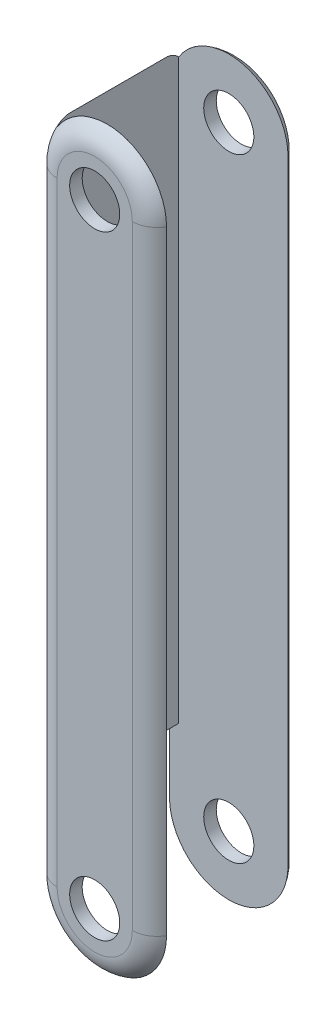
ISO-10303-21;
HEADER;
FILE_DESCRIPTION(('STEP AP214'),'2;1');
FILE_NAME('part.step','',(''),(''),'','','');
FILE_SCHEMA(('AUTOMOTIVE_DESIGN { 1 0 10303 214 1 1 1 1 }'));
ENDSEC;
DATA;
#1=APPLICATION_CONTEXT('core data for automotive mechanical design processes');
#2=APPLICATION_PROTOCOL_DEFINITION('international standard','automotive_design',2000,#1);
#3=PRODUCT_CONTEXT('',#1,'mechanical');
#4=PRODUCT('Part','Part','',(#3));
#5=PRODUCT_RELATED_PRODUCT_CATEGORY('part','',(#4));
#6=PRODUCT_DEFINITION_FORMATION('','',#4);
#7=PRODUCT_DEFINITION_CONTEXT('part definition',#1,'design');
#8=PRODUCT_DEFINITION('design','',#6,#7);
#9=PRODUCT_DEFINITION_SHAPE('','',#8);
#10=(LENGTH_UNIT() NAMED_UNIT(*) SI_UNIT(.MILLI.,.METRE.));
#11=(NAMED_UNIT(*) PLANE_ANGLE_UNIT() SI_UNIT($,.RADIAN.));
#12=(NAMED_UNIT(*) SI_UNIT($,.STERADIAN.) SOLID_ANGLE_UNIT());
#13=UNCERTAINTY_MEASURE_WITH_UNIT(LENGTH_MEASURE(1.E-05),#10,'distance_accuracy_value','');
#14=(GEOMETRIC_REPRESENTATION_CONTEXT(3) GLOBAL_UNCERTAINTY_ASSIGNED_CONTEXT((#13)) GLOBAL_UNIT_ASSIGNED_CONTEXT((#10,
#11,#12)) REPRESENTATION_CONTEXT('',''));
#15=CARTESIAN_POINT('',(0.,0.,0.));
#16=DIRECTION('',(0.,0.,1.));
#17=DIRECTION('',(1.,0.,0.));
#18=AXIS2_PLACEMENT_3D('',#15,#16,#17);
#19=CARTESIAN_POINT('',(5.,49.,11.7));
#20=DIRECTION('',(0.,0.,-1.));
#21=DIRECTION('',(-1.,0.,0.));
#22=AXIS2_PLACEMENT_3D('',#19,#20,#21);
#23=CYLINDRICAL_SURFACE('',#22,5.);
#24=CARTESIAN_POINT('',(5.,49.,9.7));
#25=DIRECTION('',(0.,0.,1.));
#26=DIRECTION('',(1.,0.,0.));
#27=AXIS2_PLACEMENT_3D('',#24,#25,#26);
#28=CIRCLE('',#27,5.);
#29=CARTESIAN_POINT('',(0.,49.,9.7));
#30=VERTEX_POINT('',#29);
#31=CARTESIAN_POINT('',(1.,52.,9.7));
#32=VERTEX_POINT('',#31);
#33=EDGE_CURVE('E260',#30,#32,#28,.F.);
#34=ORIENTED_EDGE('',*,*,#33,.T.);
#35=DIRECTION('',(0.,0.,-1.));
#36=VECTOR('',#35,1.);
#37=CARTESIAN_POINT('',(1.,52.,11.7));
#38=LINE('',#37,#36);
#39=CARTESIAN_POINT('',(1.,52.,2.));
#40=VERTEX_POINT('',#39);
#41=EDGE_CURVE('E170',#32,#40,#38,.T.);
#42=ORIENTED_EDGE('',*,*,#41,.T.);
#43=CARTESIAN_POINT('',(5.,49.,2.));
#44=DIRECTION('',(0.,0.,1.));
#45=DIRECTION('',(1.,0.,0.));
#46=AXIS2_PLACEMENT_3D('',#43,#44,#45);
#47=CIRCLE('',#46,5.);
#48=CARTESIAN_POINT('',(0.,49.,2.));
#49=VERTEX_POINT('',#48);
#50=EDGE_CURVE('E61',#40,#49,#47,.T.);
#51=ORIENTED_EDGE('',*,*,#50,.T.);
#52=DIRECTION('',(0.,0.,-1.));
#53=VECTOR('',#52,1.);
#54=CARTESIAN_POINT('',(0.,49.,11.7));
#55=LINE('',#54,#53);
#56=EDGE_CURVE('E252',#30,#49,#55,.T.);
#57=ORIENTED_EDGE('',*,*,#56,.F.);
#58=EDGE_LOOP('',(#34,#42,#51,#57));
#59=FACE_BOUND('',#58,.T.);
#60=ADVANCED_FACE('F35',(#59),#23,.T.);
#61=CARTESIAN_POINT('',(0.,49.,11.7));
#62=DIRECTION('',(1.,0.,0.));
#63=DIRECTION('',(0.,0.,-1.));
#64=AXIS2_PLACEMENT_3D('',#61,#62,#63);
#65=PLANE('',#64);
#66=DIRECTION('',(0.,-1.,0.));
#67=VECTOR('',#66,1.);
#68=CARTESIAN_POINT('',(0.,49.,2.));
#69=LINE('',#68,#67);
#70=CARTESIAN_POINT('',(0.,5.45907280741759,2.));
#71=VERTEX_POINT('',#70);
#72=EDGE_CURVE('E267',#49,#71,#69,.T.);
#73=ORIENTED_EDGE('',*,*,#72,.T.);
#74=DIRECTION('',(0.,0.,-1.));
#75=VECTOR('',#74,1.);
#76=CARTESIAN_POINT('',(0.,5.45907280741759,10.7));
#77=LINE('',#76,#75);
#78=CARTESIAN_POINT('',(0.,5.45907280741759,9.7));
#79=VERTEX_POINT('',#78);
#80=EDGE_CURVE('E149',#79,#71,#77,.T.);
#81=ORIENTED_EDGE('',*,*,#80,.F.);
#82=DIRECTION('',(0.,-1.,0.));
#83=VECTOR('',#82,1.);
#84=CARTESIAN_POINT('',(0.,49.,9.7));
#85=LINE('',#84,#83);
#86=EDGE_CURVE('E154',#79,#30,#85,.F.);
#87=ORIENTED_EDGE('',*,*,#86,.T.);
#88=ORIENTED_EDGE('',*,*,#56,.T.);
#89=EDGE_LOOP('',(#73,#81,#87,#88));
#90=FACE_BOUND('',#89,.T.);
#91=ADVANCED_FACE('F214',(#90),#65,.F.);
#92=CARTESIAN_POINT('',(5.,49.,11.7));
#93=DIRECTION('',(0.,0.,1.));
#94=DIRECTION('',(1.,0.,0.));
#95=AXIS2_PLACEMENT_3D('',#92,#93,#94);
#96=PLANE('',#95);
#97=CARTESIAN_POINT('',(5.,49.,11.7));
#98=DIRECTION('',(0.,0.,-1.));
#99=DIRECTION('',(-1.,0.,0.));
#100=AXIS2_PLACEMENT_3D('',#97,#98,#99);
#101=CIRCLE('',#100,2.);
#102=CARTESIAN_POINT('',(3.,49.,11.7));
#103=VERTEX_POINT('',#102);
#104=EDGE_CURVE('E379',#103,#103,#101,.T.);
#105=ORIENTED_EDGE('',*,*,#104,.T.);
#106=EDGE_LOOP('',(#105));
#107=FACE_BOUND('',#106,.T.);
#108=CARTESIAN_POINT('',(5.,0.,11.7));
#109=DIRECTION('',(0.,0.,-1.));
#110=DIRECTION('',(-1.,0.,0.));
#111=AXIS2_PLACEMENT_3D('',#108,#109,#110);
#112=CIRCLE('',#111,2.);
#113=CARTESIAN_POINT('',(3.,0.,11.7));
#114=VERTEX_POINT('',#113);
#115=EDGE_CURVE('E287',#114,#114,#112,.T.);
#116=ORIENTED_EDGE('',*,*,#115,.T.);
#117=EDGE_LOOP('',(#116));
#118=FACE_BOUND('',#117,.T.);
#119=DIRECTION('',(0.,-1.,0.));
#120=VECTOR('',#119,1.);
#121=CARTESIAN_POINT('',(2.,0.,11.7));
#122=LINE('',#121,#120);
#123=CARTESIAN_POINT('',(2.,49.,11.7));
#124=VERTEX_POINT('',#123);
#125=CARTESIAN_POINT('',(2.,0.,11.7));
#126=VERTEX_POINT('',#125);
#127=EDGE_CURVE('E323',#124,#126,#122,.T.);
#128=ORIENTED_EDGE('',*,*,#127,.T.);
#129=CARTESIAN_POINT('',(5.,0.,11.7));
#130=DIRECTION('',(0.,0.,1.));
#131=DIRECTION('',(1.,0.,0.));
#132=AXIS2_PLACEMENT_3D('',#129,#130,#131);
#133=CIRCLE('',#132,3.);
#134=CARTESIAN_POINT('',(8.,0.,11.7));
#135=VERTEX_POINT('',#134);
#136=EDGE_CURVE('E327',#126,#135,#133,.T.);
#137=ORIENTED_EDGE('',*,*,#136,.T.);
#138=DIRECTION('',(0.,1.,0.));
#139=VECTOR('',#138,1.);
#140=CARTESIAN_POINT('',(8.,49.,11.7));
#141=LINE('',#140,#139);
#142=CARTESIAN_POINT('',(8.,49.,11.7));
#143=VERTEX_POINT('',#142);
#144=EDGE_CURVE('E325',#135,#143,#141,.T.);
#145=ORIENTED_EDGE('',*,*,#144,.T.);
#146=CARTESIAN_POINT('',(5.,49.,11.7));
#147=DIRECTION('',(0.,0.,1.));
#148=DIRECTION('',(1.,0.,0.));
#149=AXIS2_PLACEMENT_3D('',#146,#147,#148);
#150=CIRCLE('',#149,3.);
#151=EDGE_CURVE('E248',#143,#124,#150,.T.);
#152=ORIENTED_EDGE('',*,*,#151,.T.);
#153=EDGE_LOOP('',(#128,#137,#145,#152));
#154=FACE_BOUND('',#153,.T.);
#155=ADVANCED_FACE('F219',(#107,#118,#154),#96,.T.);
#156=CARTESIAN_POINT('',(5.,49.,0.));
#157=DIRECTION('',(0.,0.,1.));
#158=DIRECTION('',(1.,0.,0.));
#159=AXIS2_PLACEMENT_3D('',#156,#157,#158);
#160=PLANE('',#159);
#161=CARTESIAN_POINT('',(5.,49.,0.));
#162=DIRECTION('',(0.,0.,-1.));
#163=DIRECTION('',(-1.,0.,0.));
#164=AXIS2_PLACEMENT_3D('',#161,#162,#163);
#165=CIRCLE('',#164,2.);
#166=CARTESIAN_POINT('',(3.,49.,0.));
#167=VERTEX_POINT('',#166);
#168=EDGE_CURVE('E377',#167,#167,#165,.T.);
#169=ORIENTED_EDGE('',*,*,#168,.F.);
#170=EDGE_LOOP('',(#169));
#171=FACE_BOUND('',#170,.T.);
#172=CARTESIAN_POINT('',(5.,0.,0.));
#173=DIRECTION('',(0.,0.,-1.));
#174=DIRECTION('',(-1.,0.,0.));
#175=AXIS2_PLACEMENT_3D('',#172,#173,#174);
#176=CIRCLE('',#175,2.);
#177=CARTESIAN_POINT('',(3.,0.,0.));
#178=VERTEX_POINT('',#177);
#179=EDGE_CURVE('E293',#178,#178,#176,.T.);
#180=ORIENTED_EDGE('',*,*,#179,.F.);
#181=EDGE_LOOP('',(#180));
#182=FACE_BOUND('',#181,.T.);
#183=DIRECTION('',(0.,1.,0.));
#184=VECTOR('',#183,1.);
#185=CARTESIAN_POINT('',(8.,49.,0.));
#186=LINE('',#185,#184);
#187=CARTESIAN_POINT('',(8.,49.,0.));
#188=VERTEX_POINT('',#187);
#189=CARTESIAN_POINT('',(8.,0.,0.));
#190=VERTEX_POINT('',#189);
#191=EDGE_CURVE('E262',#188,#190,#186,.F.);
#192=ORIENTED_EDGE('',*,*,#191,.T.);
#193=CARTESIAN_POINT('',(5.,0.,0.));
#194=DIRECTION('',(0.,0.,1.));
#195=DIRECTION('',(1.,0.,0.));
#196=AXIS2_PLACEMENT_3D('',#193,#194,#195);
#197=CIRCLE('',#196,3.);
#198=CARTESIAN_POINT('',(2.,0.,0.));
#199=VERTEX_POINT('',#198);
#200=EDGE_CURVE('E264',#190,#199,#197,.F.);
#201=ORIENTED_EDGE('',*,*,#200,.T.);
#202=DIRECTION('',(0.,-1.,0.));
#203=VECTOR('',#202,1.);
#204=CARTESIAN_POINT('',(2.,49.,0.));
#205=LINE('',#204,#203);
#206=CARTESIAN_POINT('',(2.,49.,0.));
#207=VERTEX_POINT('',#206);
#208=EDGE_CURVE('E259',#199,#207,#205,.F.);
#209=ORIENTED_EDGE('',*,*,#208,.T.);
#210=CARTESIAN_POINT('',(5.,49.,0.));
#211=DIRECTION('',(0.,0.,1.));
#212=DIRECTION('',(1.,0.,0.));
#213=AXIS2_PLACEMENT_3D('',#210,#211,#212);
#214=CIRCLE('',#213,3.);
#215=EDGE_CURVE('E257',#207,#188,#214,.F.);
#216=ORIENTED_EDGE('',*,*,#215,.T.);
#217=EDGE_LOOP('',(#192,#201,#209,#216));
#218=FACE_BOUND('',#217,.T.);
#219=ADVANCED_FACE('F193',(#171,#182,#218),#160,.F.);
#220=CARTESIAN_POINT('',(5.,49.,9.7));
#221=DIRECTION('',(0.,0.,1.));
#222=DIRECTION('',(1.,0.,0.));
#223=AXIS2_PLACEMENT_3D('',#220,#221,#222);
#224=TOROIDAL_SURFACE('',#223,3.,2.);
#225=CARTESIAN_POINT('',(5.,49.,10.7));
#226=DIRECTION('',(0.,0.,1.));
#227=DIRECTION('',(0.,-1.,0.));
#228=AXIS2_PLACEMENT_3D('',#225,#226,#227);
#229=CIRCLE('',#228,4.73205080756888);
#230=CARTESIAN_POINT('',(1.,51.5283007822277,10.7));
#231=VERTEX_POINT('',#230);
#232=CARTESIAN_POINT('',(9.73205080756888,49.,10.7));
#233=VERTEX_POINT('',#232);
#234=EDGE_CURVE('E241',#231,#233,#229,.F.);
#235=ORIENTED_EDGE('',*,*,#234,.F.);
#236=CARTESIAN_POINT('',(1.,51.8049990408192,10.3670267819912));
#237=CARTESIAN_POINT('',(1.,51.7494559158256,10.4571497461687));
#238=CARTESIAN_POINT('',(1.,51.6838486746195,10.5411533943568));
#239=CARTESIAN_POINT('',(1.,51.5380351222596,10.6954518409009));
#240=CARTESIAN_POINT('',(1.,51.4577741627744,10.7656932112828));
#241=CARTESIAN_POINT('',(1.,51.262254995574,10.9114934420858));
#242=CARTESIAN_POINT('',(1.,51.1436542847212,10.9825170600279));
#243=CARTESIAN_POINT('',(1.,50.8970590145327,11.1050984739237));
#244=CARTESIAN_POINT('',(1.,50.7690564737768,11.1566394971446));
#245=CARTESIAN_POINT('',(1.,50.5228979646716,11.238888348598));
#246=CARTESIAN_POINT('',(1.,50.4052940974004,11.2713065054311));
#247=CARTESIAN_POINT('',(1.,50.1676975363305,11.3259995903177));
#248=CARTESIAN_POINT('',(1.,50.0477027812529,11.3482653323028));
#249=CARTESIAN_POINT('',(1.,49.8059350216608,11.3844989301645));
#250=CARTESIAN_POINT('',(1.,49.684156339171,11.3984276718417));
#251=CARTESIAN_POINT('',(1.,49.44005116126,11.4190868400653));
#252=CARTESIAN_POINT('',(1.,49.3177248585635,11.425819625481));
#253=CARTESIAN_POINT('',(1.,49.0561752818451,11.4332359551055));
#254=CARTESIAN_POINT('',(1.,48.916925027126,11.4329682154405));
#255=CARTESIAN_POINT('',(1.,48.63861658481,11.4239813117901));
#256=CARTESIAN_POINT('',(1.,48.4995585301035,11.4152578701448));
#257=CARTESIAN_POINT('',(1.,48.2230908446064,11.388327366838));
#258=CARTESIAN_POINT('',(1.,48.0856763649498,11.3701719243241));
#259=CARTESIAN_POINT('',(1.,47.8129316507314,11.322365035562));
#260=CARTESIAN_POINT('',(1.,47.6775991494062,11.292727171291));
#261=CARTESIAN_POINT('',(1.,47.4368360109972,11.2262150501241));
#262=CARTESIAN_POINT('',(1.,47.3307168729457,11.1918758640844));
#263=CARTESIAN_POINT('',(1.,47.1225973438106,11.1119698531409));
#264=CARTESIAN_POINT('',(1.,47.020600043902,11.0663947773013));
#265=CARTESIAN_POINT('',(1.,46.8224631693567,10.9616206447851));
#266=CARTESIAN_POINT('',(1.,46.7263889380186,10.9022954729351));
#267=CARTESIAN_POINT('',(1.,46.5452630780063,10.7686213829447));
#268=CARTESIAN_POINT('',(1.,46.4601898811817,10.6943026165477));
#269=CARTESIAN_POINT('',(1.,46.3289326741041,10.5541171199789));
#270=CARTESIAN_POINT('',(1.,46.2786425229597,10.492105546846));
#271=CARTESIAN_POINT('',(1.,46.1886400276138,10.360766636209));
#272=CARTESIAN_POINT('',(1.,46.148922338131,10.2914430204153));
#273=CARTESIAN_POINT('',(1.,46.0821739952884,10.1461751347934));
#274=CARTESIAN_POINT('',(1.,46.0552484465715,10.070181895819));
#275=CARTESIAN_POINT('',(1.,46.0166099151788,9.91441021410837));
#276=CARTESIAN_POINT('',(1.,46.0048856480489,9.83463462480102));
#277=CARTESIAN_POINT('',(1.,45.9980366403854,9.68416995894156));
#278=CARTESIAN_POINT('',(1.,46.001060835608,9.61356002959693));
#279=CARTESIAN_POINT('',(1.,46.0193349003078,9.47396038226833));
#280=CARTESIAN_POINT('',(1.,46.0345827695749,9.40497040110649));
#281=CARTESIAN_POINT('',(1.,46.0757165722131,9.27254940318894));
#282=CARTESIAN_POINT('',(1.,46.101270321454,9.20901379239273));
#283=CARTESIAN_POINT('',(1.,46.1616385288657,9.08653782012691));
#284=CARTESIAN_POINT('',(1.,46.1964564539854,9.02759918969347));
#285=CARTESIAN_POINT('',(1.,46.288344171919,8.89406099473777));
#286=CARTESIAN_POINT('',(1.,46.3488677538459,8.82183493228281));
#287=CARTESIAN_POINT('',(1.,46.4808336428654,8.68818613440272));
#288=CARTESIAN_POINT('',(1.,46.5522960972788,8.62678379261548));
#289=CARTESIAN_POINT('',(1.,46.7361735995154,8.48969787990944));
#290=CARTESIAN_POINT('',(1.,46.8527590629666,8.41964267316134));
#291=CARTESIAN_POINT('',(1.,47.0952161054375,8.29838023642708));
#292=CARTESIAN_POINT('',(1.,47.2211039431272,8.24720699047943));
#293=CARTESIAN_POINT('',(1.,47.4640616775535,8.16501814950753));
#294=CARTESIAN_POINT('',(1.,47.5806137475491,8.13242151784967));
#295=CARTESIAN_POINT('',(1.,47.816127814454,8.07729729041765));
#296=CARTESIAN_POINT('',(1.,47.9350919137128,8.05477891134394));
#297=CARTESIAN_POINT('',(1.,48.1747797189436,8.01798954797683));
#298=CARTESIAN_POINT('',(1.,48.2955088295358,8.0037548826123));
#299=CARTESIAN_POINT('',(1.,48.5375349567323,7.98242360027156));
#300=CARTESIAN_POINT('',(1.,48.658831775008,7.97532465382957));
#301=CARTESIAN_POINT('',(1.,48.9180728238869,7.96704252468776));
#302=CARTESIAN_POINT('',(1.,49.0560467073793,7.9667907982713));
#303=CARTESIAN_POINT('',(1.,49.3318361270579,7.97455043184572));
#304=CARTESIAN_POINT('',(1.,49.4696515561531,7.98256573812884));
#305=CARTESIAN_POINT('',(1.,49.7437572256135,8.00779632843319));
#306=CARTESIAN_POINT('',(1.,49.8800516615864,8.02496434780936));
#307=CARTESIAN_POINT('',(1.,50.150714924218,8.0703853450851));
#308=CARTESIAN_POINT('',(1.,50.2850856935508,8.09862618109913));
#309=CARTESIAN_POINT('',(1.,50.5267941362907,8.1627535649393));
#310=CARTESIAN_POINT('',(1.,50.6347134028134,8.19640760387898));
#311=CARTESIAN_POINT('',(1.,50.8465401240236,8.27504247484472));
#312=CARTESIAN_POINT('',(1.,50.9504445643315,8.32003163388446));
#313=CARTESIAN_POINT('',(1.,51.1525266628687,8.42381451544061));
#314=CARTESIAN_POINT('',(1.,51.2506396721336,8.48273677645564));
#315=CARTESIAN_POINT('',(1.,51.4359102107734,8.61591229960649));
#316=CARTESIAN_POINT('',(1.,51.5230896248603,8.69013412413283));
#317=CARTESIAN_POINT('',(1.,51.6575315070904,8.83014508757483));
#318=CARTESIAN_POINT('',(1.,51.7089672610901,8.89191570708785));
#319=CARTESIAN_POINT('',(1.,51.8013192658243,9.0229428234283));
#320=CARTESIAN_POINT('',(1.,51.8422406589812,9.09219563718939));
#321=CARTESIAN_POINT('',(1.,51.9114113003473,9.23755450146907));
#322=CARTESIAN_POINT('',(1.,51.939552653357,9.31371261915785));
#323=CARTESIAN_POINT('',(1.,51.9805177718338,9.4700582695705));
#324=CARTESIAN_POINT('',(1.,51.9933530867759,9.55024271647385));
#325=CARTESIAN_POINT('',(1.,52.0020832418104,9.70146500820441));
#326=CARTESIAN_POINT('',(1.,51.9998892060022,9.77239794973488));
#327=CARTESIAN_POINT('',(1.,51.9831332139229,9.91275980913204));
#328=CARTESIAN_POINT('',(1.,51.9685764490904,9.9821893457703));
#329=CARTESIAN_POINT('',(1.,51.9316234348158,10.1056150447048));
#330=CARTESIAN_POINT('',(1.,51.9110619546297,10.1601739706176));
#331=CARTESIAN_POINT('',(1.,51.8630129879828,10.266113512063));
#332=CARTESIAN_POINT('',(1.,51.8355260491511,10.3174943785));
#333=CARTESIAN_POINT('',(1.,51.8049990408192,10.3670267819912));
#334=B_SPLINE_CURVE_WITH_KNOTS('',3,(#236,#237,#238,#239,#240,#241,#242,#243,#244,#245,#246,
#247,#248,#249,#250,#251,#252,#253,#254,#255,#256,#257,#258,#259,#260,#261,#262,#263,#264,#265,
#266,#267,#268,#269,#270,#271,#272,#273,#274,#275,#276,#277,#278,#279,#280,#281,#282,#283,#284,
#285,#286,#287,#288,#289,#290,#291,#292,#293,#294,#295,#296,#297,#298,#299,#300,#301,#302,#303,
#304,#305,#306,#307,#308,#309,#310,#311,#312,#313,#314,#315,#316,#317,#318,#319,#320,#321,#322,
#323,#324,#325,#326,#327,#328,#329,#330,#331,#332,#333),.UNSPECIFIED.,.T.,.F.,(4,2,2,2,2,2,2,2,
2,2,2,2,2,2,2,2,2,2,2,2,2,2,2,2,2,2,2,2,2,2,2,2,2,2,2,2,2,2,2,2,2,2,2,2,2,2,2,2,4),(0.,
0.317285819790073,0.635780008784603,1.04815189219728,1.46087798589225,1.82631752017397,
2.1920870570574,2.55955946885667,2.92691138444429,3.34441221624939,3.76212436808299,
4.17757419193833,4.59253409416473,4.92664318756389,5.26099836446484,5.59855089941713,
5.93543127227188,6.17407342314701,6.41259468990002,6.65304321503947,6.89331314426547,
7.10426269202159,7.31517772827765,7.51977774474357,7.72445443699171,8.00558356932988,
8.2872368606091,8.69299180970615,9.09947352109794,9.46201522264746,9.82488779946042,
10.1893395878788,10.5536723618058,10.9673504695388,11.381226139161,11.7929849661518,
12.2042935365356,12.5429296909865,12.8818153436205,13.2239585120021,13.5654055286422,
13.8056729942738,14.0458227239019,14.287963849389,14.529922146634,14.7417392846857,
14.9534675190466,15.1278644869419,15.3022476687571),.UNSPECIFIED.);
#335=EDGE_CURVE('E181',#32,#231,#334,.T.);
#336=ORIENTED_EDGE('',*,*,#335,.F.);
#337=ORIENTED_EDGE('',*,*,#33,.F.);
#338=CARTESIAN_POINT('',(2.,49.,9.7));
#339=DIRECTION('',(0.,-1.,0.));
#340=DIRECTION('',(0.,0.,-1.));
#341=AXIS2_PLACEMENT_3D('',#338,#339,#340);
#342=CIRCLE('',#341,2.);
#343=EDGE_CURVE('E249',#124,#30,#342,.T.);
#344=ORIENTED_EDGE('',*,*,#343,.F.);
#345=ORIENTED_EDGE('',*,*,#151,.F.);
#346=CARTESIAN_POINT('',(8.,49.,9.7));
#347=DIRECTION('',(0.,-1.,0.));
#348=DIRECTION('',(0.,0.,-1.));
#349=AXIS2_PLACEMENT_3D('',#346,#347,#348);
#350=CIRCLE('',#349,2.);
#351=EDGE_CURVE('E238',#233,#143,#350,.T.);
#352=ORIENTED_EDGE('',*,*,#351,.F.);
#353=EDGE_LOOP('',(#235,#336,#337,#344,#345,#352));
#354=FACE_BOUND('',#353,.T.);
#355=ADVANCED_FACE('F188',(#354),#224,.T.);
#356=CARTESIAN_POINT('',(2.,49.,9.7));
#357=DIRECTION('',(0.,1.,0.));
#358=DIRECTION('',(0.,0.,1.));
#359=AXIS2_PLACEMENT_3D('',#356,#357,#358);
#360=CYLINDRICAL_SURFACE('',#359,2.);
#361=CARTESIAN_POINT('',(2.,5.45907280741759,9.7));
#362=DIRECTION('',(0.,1.,0.));
#363=DIRECTION('',(0.,0.,1.));
#364=AXIS2_PLACEMENT_3D('',#361,#362,#363);
#365=CIRCLE('',#364,2.);
#366=CARTESIAN_POINT('',(0.267949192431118,5.45907280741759,10.7));
#367=VERTEX_POINT('',#366);
#368=EDGE_CURVE('E146',#367,#79,#365,.F.);
#369=ORIENTED_EDGE('',*,*,#368,.F.);
#370=DIRECTION('',(0.,1.,0.));
#371=VECTOR('',#370,1.);
#372=CARTESIAN_POINT('',(0.267949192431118,49.,10.7));
#373=LINE('',#372,#371);
#374=CARTESIAN_POINT('',(0.267949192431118,0.,10.7));
#375=VERTEX_POINT('',#374);
#376=EDGE_CURVE('E134',#375,#367,#373,.T.);
#377=ORIENTED_EDGE('',*,*,#376,.F.);
#378=CARTESIAN_POINT('',(2.,0.,9.7));
#379=DIRECTION('',(0.,-1.,0.));
#380=DIRECTION('',(1.,0.,0.));
#381=AXIS2_PLACEMENT_3D('',#378,#379,#380);
#382=CIRCLE('',#381,2.);
#383=EDGE_CURVE('E250',#126,#375,#382,.T.);
#384=ORIENTED_EDGE('',*,*,#383,.F.);
#385=ORIENTED_EDGE('',*,*,#127,.F.);
#386=ORIENTED_EDGE('',*,*,#343,.T.);
#387=ORIENTED_EDGE('',*,*,#86,.F.);
#388=EDGE_LOOP('',(#369,#377,#384,#385,#386,#387));
#389=FACE_BOUND('',#388,.T.);
#390=ADVANCED_FACE('F152',(#389),#360,.T.);
#391=CARTESIAN_POINT('',(8.,49.,9.7));
#392=DIRECTION('',(0.,-1.,0.));
#393=DIRECTION('',(0.,0.,-1.));
#394=AXIS2_PLACEMENT_3D('',#391,#392,#393);
#395=CYLINDRICAL_SURFACE('',#394,2.);
#396=DIRECTION('',(0.,-1.,0.));
#397=VECTOR('',#396,1.);
#398=CARTESIAN_POINT('',(9.73205080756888,49.,10.7));
#399=LINE('',#398,#397);
#400=CARTESIAN_POINT('',(9.73205080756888,0.,10.7));
#401=VERTEX_POINT('',#400);
#402=EDGE_CURVE('E235',#233,#401,#399,.T.);
#403=ORIENTED_EDGE('',*,*,#402,.F.);
#404=ORIENTED_EDGE('',*,*,#351,.T.);
#405=ORIENTED_EDGE('',*,*,#144,.F.);
#406=CARTESIAN_POINT('',(8.,0.,9.7));
#407=DIRECTION('',(0.,-1.,0.));
#408=DIRECTION('',(0.,0.,-1.));
#409=AXIS2_PLACEMENT_3D('',#406,#407,#408);
#410=CIRCLE('',#409,2.);
#411=EDGE_CURVE('E240',#401,#135,#410,.T.);
#412=ORIENTED_EDGE('',*,*,#411,.F.);
#413=EDGE_LOOP('',(#403,#404,#405,#412));
#414=FACE_BOUND('',#413,.T.);
#415=ADVANCED_FACE('F226',(#414),#395,.T.);
#416=CARTESIAN_POINT('',(5.,0.,9.7));
#417=DIRECTION('',(0.,0.,1.));
#418=DIRECTION('',(1.,0.,0.));
#419=AXIS2_PLACEMENT_3D('',#416,#417,#418);
#420=TOROIDAL_SURFACE('',#419,3.,2.);
#421=ORIENTED_EDGE('',*,*,#383,.T.);
#422=CARTESIAN_POINT('',(5.,0.,10.7));
#423=DIRECTION('',(0.,0.,1.));
#424=DIRECTION('',(0.,-1.,0.));
#425=AXIS2_PLACEMENT_3D('',#422,#423,#424);
#426=CIRCLE('',#425,4.73205080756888);
#427=EDGE_CURVE('E45',#401,#375,#426,.F.);
#428=ORIENTED_EDGE('',*,*,#427,.F.);
#429=ORIENTED_EDGE('',*,*,#411,.T.);
#430=ORIENTED_EDGE('',*,*,#136,.F.);
#431=EDGE_LOOP('',(#421,#428,#429,#430));
#432=FACE_BOUND('',#431,.T.);
#433=ADVANCED_FACE('F210',(#432),#420,.T.);
#434=CARTESIAN_POINT('',(5.,49.,2.));
#435=DIRECTION('',(0.,0.,1.));
#436=DIRECTION('',(1.,0.,0.));
#437=AXIS2_PLACEMENT_3D('',#434,#435,#436);
#438=TOROIDAL_SURFACE('',#437,3.,2.);
#439=CARTESIAN_POINT('',(5.,49.,1.));
#440=DIRECTION('',(0.,0.,-1.));
#441=DIRECTION('',(-1.,0.,0.));
#442=AXIS2_PLACEMENT_3D('',#439,#440,#441);
#443=CIRCLE('',#442,4.73205080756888);
#444=CARTESIAN_POINT('',(9.73205080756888,49.,1.));
#445=VERTEX_POINT('',#444);
#446=CARTESIAN_POINT('',(1.,51.5283007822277,1.));
#447=VERTEX_POINT('',#446);
#448=EDGE_CURVE('E242',#445,#447,#443,.F.);
#449=ORIENTED_EDGE('',*,*,#448,.F.);
#450=CARTESIAN_POINT('',(8.,49.,2.));
#451=DIRECTION('',(0.,-1.,0.));
#452=DIRECTION('',(0.,0.,-1.));
#453=AXIS2_PLACEMENT_3D('',#450,#451,#452);
#454=CIRCLE('',#453,2.);
#455=EDGE_CURVE('E277',#188,#445,#454,.T.);
#456=ORIENTED_EDGE('',*,*,#455,.F.);
#457=ORIENTED_EDGE('',*,*,#215,.F.);
#458=CARTESIAN_POINT('',(2.,49.,2.));
#459=DIRECTION('',(0.,-1.,0.));
#460=DIRECTION('',(0.,0.,-1.));
#461=AXIS2_PLACEMENT_3D('',#458,#459,#460);
#462=CIRCLE('',#461,2.);
#463=EDGE_CURVE('E280',#49,#207,#462,.T.);
#464=ORIENTED_EDGE('',*,*,#463,.F.);
#465=ORIENTED_EDGE('',*,*,#50,.F.);
#466=CARTESIAN_POINT('',(1.,51.8049990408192,1.33297321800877));
#467=CARTESIAN_POINT('',(1.,51.8421269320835,1.39321554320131));
#468=CARTESIAN_POINT('',(1.,51.8747653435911,1.45620608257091));
#469=CARTESIAN_POINT('',(1.,51.9294944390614,1.58664951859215));
#470=CARTESIAN_POINT('',(1.,51.9515901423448,1.65410027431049));
#471=CARTESIAN_POINT('',(1.,51.9839835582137,1.79209865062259));
#472=CARTESIAN_POINT('',(1.,51.9942324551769,1.86265784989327));
#473=CARTESIAN_POINT('',(1.,52.0020882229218,2.00447978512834));
#474=CARTESIAN_POINT('',(1.,51.9996967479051,2.07574242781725));
#475=CARTESIAN_POINT('',(1.,51.9828183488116,2.21365070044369));
#476=CARTESIAN_POINT('',(1.,51.9688610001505,2.2803624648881));
#477=CARTESIAN_POINT('',(1.,51.9303663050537,2.41063466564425));
#478=CARTESIAN_POINT('',(1.,51.9058276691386,2.47419471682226));
#479=CARTESIAN_POINT('',(1.,51.8462524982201,2.59935752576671));
#480=CARTESIAN_POINT('',(1.,51.8108278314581,2.66077406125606));
#481=CARTESIAN_POINT('',(1.,51.7315695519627,2.77788603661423));
#482=CARTESIAN_POINT('',(1.,51.687730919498,2.833578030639));
#483=CARTESIAN_POINT('',(1.,51.5695362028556,2.96530370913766));
#484=CARTESIAN_POINT('',(1.,51.4909086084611,3.03751236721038));
#485=CARTESIAN_POINT('',(1.,51.3231595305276,3.1683829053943));
#486=CARTESIAN_POINT('',(1.,51.2340187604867,3.22701928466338));
#487=CARTESIAN_POINT('',(1.,50.9983131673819,3.36067275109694));
#488=CARTESIAN_POINT('',(1.,50.8469577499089,3.42716681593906));
#489=CARTESIAN_POINT('',(1.,50.5359699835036,3.5369764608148));
#490=CARTESIAN_POINT('',(1.,50.3763087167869,3.58020416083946));
#491=CARTESIAN_POINT('',(1.,50.0580108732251,3.64782235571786));
#492=CARTESIAN_POINT('',(1.,49.8994773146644,3.67271970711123));
#493=CARTESIAN_POINT('',(1.,49.5807813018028,3.70934746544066));
#494=CARTESIAN_POINT('',(1.,49.4206170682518,3.72106147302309));
#495=CARTESIAN_POINT('',(1.,49.099833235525,3.73322114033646));
#496=CARTESIAN_POINT('',(1.,48.9392134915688,3.73366268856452));
#497=CARTESIAN_POINT('',(1.,48.6184338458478,3.72335467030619));
#498=CARTESIAN_POINT('',(1.,48.4582736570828,3.7126153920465));
#499=CARTESIAN_POINT('',(1.,48.2151993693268,3.68633392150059));
#500=CARTESIAN_POINT('',(1.,48.1317670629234,3.67550367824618));
#501=CARTESIAN_POINT('',(1.,47.965514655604,3.64978818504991));
#502=CARTESIAN_POINT('',(1.,47.8826945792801,3.63490277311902));
#503=CARTESIAN_POINT('',(1.,47.718143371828,3.60053769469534));
#504=CARTESIAN_POINT('',(1.,47.6364106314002,3.5810658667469));
#505=CARTESIAN_POINT('',(1.,47.4744027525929,3.53683887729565));
#506=CARTESIAN_POINT('',(1.,47.3941272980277,3.51208487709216));
#507=CARTESIAN_POINT('',(1.,47.1900042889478,3.44052538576));
#508=CARTESIAN_POINT('',(1.,47.0676680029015,3.38922776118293));
#509=CARTESIAN_POINT('',(1.,46.8322262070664,3.26839723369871));
#510=CARTESIAN_POINT('',(1.,46.7191056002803,3.19889497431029));
#511=CARTESIAN_POINT('',(1.,46.5423479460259,3.06475028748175));
#512=CARTESIAN_POINT('',(1.,46.4744823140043,3.00570871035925));
#513=CARTESIAN_POINT('',(1.,46.348778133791,2.87773157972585));
#514=CARTESIAN_POINT('',(1.,46.290926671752,2.80880898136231));
#515=CARTESIAN_POINT('',(1.,46.1969226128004,2.67374772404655));
#516=CARTESIAN_POINT('',(1.,46.1587667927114,2.60901050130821));
#517=CARTESIAN_POINT('',(1.,46.0937207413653,2.47406112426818));
#518=CARTESIAN_POINT('',(1.,46.0668258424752,2.40385125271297));
#519=CARTESIAN_POINT('',(1.,46.0258974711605,2.25931865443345));
#520=CARTESIAN_POINT('',(1.,46.0119347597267,2.18497563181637));
#521=CARTESIAN_POINT('',(1.,45.9981584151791,2.03498917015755));
#522=CARTESIAN_POINT('',(1.,45.9983400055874,1.95934617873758));
#523=CARTESIAN_POINT('',(1.,46.0121312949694,1.81650495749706));
#524=CARTESIAN_POINT('',(1.,46.024479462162,1.74918031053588));
#525=CARTESIAN_POINT('',(1.,46.0600004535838,1.61747837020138));
#526=CARTESIAN_POINT('',(1.,46.0831731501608,1.55310104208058));
#527=CARTESIAN_POINT('',(1.,46.139919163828,1.42687630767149));
#528=CARTESIAN_POINT('',(1.,46.1737764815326,1.36515770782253));
#529=CARTESIAN_POINT('',(1.,46.2500207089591,1.24726581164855));
#530=CARTESIAN_POINT('',(1.,46.2924125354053,1.19109573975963));
#531=CARTESIAN_POINT('',(1.,46.4062404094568,1.05909948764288));
#532=CARTESIAN_POINT('',(1.,46.481827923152,0.986846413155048));
#533=CARTESIAN_POINT('',(1.,46.6435759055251,0.855432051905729));
#534=CARTESIAN_POINT('',(1.,46.7297560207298,0.796295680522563));
#535=CARTESIAN_POINT('',(1.,46.9565056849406,0.661951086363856));
#536=CARTESIAN_POINT('',(1.,47.1017725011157,0.594736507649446));
#537=CARTESIAN_POINT('',(1.,47.4007451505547,0.482763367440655));
#538=CARTESIAN_POINT('',(1.,47.5544773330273,0.438079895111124));
#539=CARTESIAN_POINT('',(1.,47.8599903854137,0.367508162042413));
#540=CARTESIAN_POINT('',(1.,48.0116294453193,0.340979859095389));
#541=CARTESIAN_POINT('',(1.,48.3166845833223,0.300601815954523));
#542=CARTESIAN_POINT('',(1.,48.4701025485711,0.286767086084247));
#543=CARTESIAN_POINT('',(1.,48.7777233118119,0.269742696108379));
#544=CARTESIAN_POINT('',(1.,48.9319269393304,0.266568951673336));
#545=CARTESIAN_POINT('',(1.,49.2401163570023,0.27039802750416));
#546=CARTESIAN_POINT('',(1.,49.394102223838,0.277393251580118));
#547=CARTESIAN_POINT('',(1.,49.6412507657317,0.297743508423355));
#548=CARTESIAN_POINT('',(1.,49.7347102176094,0.307553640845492));
#549=CARTESIAN_POINT('',(1.,49.9210005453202,0.331925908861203));
#550=CARTESIAN_POINT('',(1.,50.0138315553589,0.346486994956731));
#551=CARTESIAN_POINT('',(1.,50.1982317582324,0.381035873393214));
#552=CARTESIAN_POINT('',(1.,50.2898037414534,0.401008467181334));
#553=CARTESIAN_POINT('',(1.,50.4713104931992,0.447289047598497));
#554=CARTESIAN_POINT('',(1.,50.5612458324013,0.473594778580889));
#555=CARTESIAN_POINT('',(1.,50.7728861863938,0.545152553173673));
#556=CARTESIAN_POINT('',(1.,50.8934868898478,0.593799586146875));
#557=CARTESIAN_POINT('',(1.,51.126531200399,0.708356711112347));
#558=CARTESIAN_POINT('',(1.,51.2389726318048,0.774271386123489));
#559=CARTESIAN_POINT('',(1.,51.4353767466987,0.915597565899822));
#560=CARTESIAN_POINT('',(1.,51.5211310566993,0.98847623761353));
#561=CARTESIAN_POINT('',(1.,51.6766122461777,1.14965127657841));
#562=CARTESIAN_POINT('',(1.,51.7463977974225,1.23788903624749));
#563=CARTESIAN_POINT('',(1.,51.8049990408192,1.33297321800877));
#564=B_SPLINE_CURVE_WITH_KNOTS('',3,(#466,#467,#468,#469,#470,#471,#472,#473,#474,#475,#476,
#477,#478,#479,#480,#481,#482,#483,#484,#485,#486,#487,#488,#489,#490,#491,#492,#493,#494,#495,
#496,#497,#498,#499,#500,#501,#502,#503,#504,#505,#506,#507,#508,#509,#510,#511,#512,#513,#514,
#515,#516,#517,#518,#519,#520,#521,#522,#523,#524,#525,#526,#527,#528,#529,#530,#531,#532,#533,
#534,#535,#536,#537,#538,#539,#540,#541,#542,#543,#544,#545,#546,#547,#548,#549,#550,#551,#552,
#553,#554,#555,#556,#557,#558,#559,#560,#561,#562,#563),.UNSPECIFIED.,.T.,.F.,(4,2,2,2,2,2,2,2,
2,2,2,2,2,2,2,2,2,2,2,2,2,2,2,2,2,2,2,2,2,2,2,2,2,2,2,2,2,2,2,2,2,2,2,2,2,2,2,2,4),(0.,
0.212029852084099,0.423958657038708,0.636757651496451,0.84952879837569,1.05306345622,
1.25662292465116,1.46850356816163,1.68051101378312,1.99895781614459,2.31799817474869,
2.81114378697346,3.30613922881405,3.78687275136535,4.26820362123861,4.74971004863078,
5.23077380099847,5.48309142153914,5.73541912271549,5.98731866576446,6.23916288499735,
6.63594222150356,7.03205791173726,7.30102769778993,7.5696480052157,7.79415689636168,
8.01857263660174,8.24420917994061,8.46976952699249,8.67416598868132,8.87856004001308,
9.08892376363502,9.29940902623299,9.61133411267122,9.92384672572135,10.4013208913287,
10.8803759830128,11.3415267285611,11.8032220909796,12.2656064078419,12.7276455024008,
13.0094658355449,13.2912239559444,13.5721988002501,13.8530737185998,14.2421227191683,
14.6312750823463,14.9671896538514,15.3018494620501),.UNSPECIFIED.);
#565=EDGE_CURVE('E165',#447,#40,#564,.T.);
#566=ORIENTED_EDGE('',*,*,#565,.F.);
#567=EDGE_LOOP('',(#449,#456,#457,#464,#465,#566));
#568=FACE_BOUND('',#567,.T.);
#569=ADVANCED_FACE('F37',(#568),#438,.T.);
#570=CARTESIAN_POINT('',(2.,49.,2.));
#571=DIRECTION('',(0.,-1.,0.));
#572=DIRECTION('',(0.,0.,-1.));
#573=AXIS2_PLACEMENT_3D('',#570,#571,#572);
#574=CYLINDRICAL_SURFACE('',#573,2.);
#575=DIRECTION('',(0.,-1.,0.));
#576=VECTOR('',#575,1.);
#577=CARTESIAN_POINT('',(0.267949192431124,49.,0.999999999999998));
#578=LINE('',#577,#576);
#579=CARTESIAN_POINT('',(0.267949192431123,5.45907280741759,1.));
#580=VERTEX_POINT('',#579);
#581=CARTESIAN_POINT('',(0.267949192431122,0.,1.));
#582=VERTEX_POINT('',#581);
#583=EDGE_CURVE('E155',#580,#582,#578,.T.);
#584=ORIENTED_EDGE('',*,*,#583,.F.);
#585=CARTESIAN_POINT('',(2.,5.45907280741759,2.));
#586=DIRECTION('',(0.,1.,0.));
#587=DIRECTION('',(0.,0.,1.));
#588=AXIS2_PLACEMENT_3D('',#585,#586,#587);
#589=CIRCLE('',#588,2.);
#590=EDGE_CURVE('E141',#71,#580,#589,.F.);
#591=ORIENTED_EDGE('',*,*,#590,.F.);
#592=ORIENTED_EDGE('',*,*,#72,.F.);
#593=ORIENTED_EDGE('',*,*,#463,.T.);
#594=ORIENTED_EDGE('',*,*,#208,.F.);
#595=CARTESIAN_POINT('',(2.,0.,2.));
#596=DIRECTION('',(0.,-1.,0.));
#597=DIRECTION('',(0.,0.,-1.));
#598=AXIS2_PLACEMENT_3D('',#595,#596,#597);
#599=CIRCLE('',#598,2.);
#600=EDGE_CURVE('E275',#582,#199,#599,.T.);
#601=ORIENTED_EDGE('',*,*,#600,.F.);
#602=EDGE_LOOP('',(#584,#591,#592,#593,#594,#601));
#603=FACE_BOUND('',#602,.T.);
#604=ADVANCED_FACE('F203',(#603),#574,.T.);
#605=CARTESIAN_POINT('',(8.,0.,2.));
#606=DIRECTION('',(0.,1.,0.));
#607=DIRECTION('',(0.,0.,1.));
#608=AXIS2_PLACEMENT_3D('',#605,#606,#607);
#609=CYLINDRICAL_SURFACE('',#608,2.);
#610=DIRECTION('',(0.,1.,0.));
#611=VECTOR('',#610,1.);
#612=CARTESIAN_POINT('',(9.73205080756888,0.,1.));
#613=LINE('',#612,#611);
#614=CARTESIAN_POINT('',(9.73205080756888,0.,1.));
#615=VERTEX_POINT('',#614);
#616=EDGE_CURVE('E186',#615,#445,#613,.T.);
#617=ORIENTED_EDGE('',*,*,#616,.F.);
#618=CARTESIAN_POINT('',(8.,0.,2.));
#619=DIRECTION('',(0.,-1.,0.));
#620=DIRECTION('',(1.,0.,0.));
#621=AXIS2_PLACEMENT_3D('',#618,#619,#620);
#622=CIRCLE('',#621,2.);
#623=EDGE_CURVE('E272',#190,#615,#622,.T.);
#624=ORIENTED_EDGE('',*,*,#623,.F.);
#625=ORIENTED_EDGE('',*,*,#191,.F.);
#626=ORIENTED_EDGE('',*,*,#455,.T.);
#627=EDGE_LOOP('',(#617,#624,#625,#626));
#628=FACE_BOUND('',#627,.T.);
#629=ADVANCED_FACE('F200',(#628),#609,.T.);
#630=CARTESIAN_POINT('',(5.,0.,2.));
#631=DIRECTION('',(0.,0.,1.));
#632=DIRECTION('',(1.,0.,0.));
#633=AXIS2_PLACEMENT_3D('',#630,#631,#632);
#634=TOROIDAL_SURFACE('',#633,3.,2.);
#635=CARTESIAN_POINT('',(5.,0.,1.));
#636=DIRECTION('',(0.,0.,-1.));
#637=DIRECTION('',(-1.,0.,0.));
#638=AXIS2_PLACEMENT_3D('',#635,#636,#637);
#639=CIRCLE('',#638,4.73205080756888);
#640=EDGE_CURVE('E271',#582,#615,#639,.F.);
#641=ORIENTED_EDGE('',*,*,#640,.F.);
#642=ORIENTED_EDGE('',*,*,#600,.T.);
#643=ORIENTED_EDGE('',*,*,#200,.F.);
#644=ORIENTED_EDGE('',*,*,#623,.T.);
#645=EDGE_LOOP('',(#641,#642,#643,#644));
#646=FACE_BOUND('',#645,.T.);
#647=ADVANCED_FACE('F196',(#646),#634,.T.);
#648=CARTESIAN_POINT('',(1.,-9.35386078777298,1.));
#649=DIRECTION('',(0.,0.,-1.));
#650=DIRECTION('',(-1.,0.,0.));
#651=AXIS2_PLACEMENT_3D('',#648,#649,#650);
#652=PLANE('',#651);
#653=CARTESIAN_POINT('',(5.,49.,1.));
#654=DIRECTION('',(0.,0.,-1.));
#655=DIRECTION('',(-1.,0.,0.));
#656=AXIS2_PLACEMENT_3D('',#653,#654,#655);
#657=CIRCLE('',#656,2.);
#658=CARTESIAN_POINT('',(3.,49.,1.));
#659=VERTEX_POINT('',#658);
#660=EDGE_CURVE('E298',#659,#659,#657,.T.);
#661=ORIENTED_EDGE('',*,*,#660,.T.);
#662=EDGE_LOOP('',(#661));
#663=FACE_BOUND('',#662,.T.);
#664=CARTESIAN_POINT('',(5.,0.,1.));
#665=DIRECTION('',(0.,0.,-1.));
#666=DIRECTION('',(-1.,0.,0.));
#667=AXIS2_PLACEMENT_3D('',#664,#665,#666);
#668=CIRCLE('',#667,2.);
#669=CARTESIAN_POINT('',(3.,0.,1.));
#670=VERTEX_POINT('',#669);
#671=EDGE_CURVE('E286',#670,#670,#668,.T.);
#672=ORIENTED_EDGE('',*,*,#671,.T.);
#673=EDGE_LOOP('',(#672));
#674=FACE_BOUND('',#673,.T.);
#675=DIRECTION('',(0.,1.,0.));
#676=VECTOR('',#675,1.);
#677=CARTESIAN_POINT('',(1.,-9.35386078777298,1.));
#678=LINE('',#677,#676);
#679=CARTESIAN_POINT('',(1.,5.45907280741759,1.));
#680=VERTEX_POINT('',#679);
#681=EDGE_CURVE('E158',#680,#447,#678,.T.);
#682=ORIENTED_EDGE('',*,*,#681,.F.);
#683=DIRECTION('',(-1.,0.,0.));
#684=VECTOR('',#683,1.);
#685=CARTESIAN_POINT('',(9.,5.45907280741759,1.));
#686=LINE('',#685,#684);
#687=EDGE_CURVE('E142',#680,#580,#686,.T.);
#688=ORIENTED_EDGE('',*,*,#687,.T.);
#689=ORIENTED_EDGE('',*,*,#583,.T.);
#690=ORIENTED_EDGE('',*,*,#640,.T.);
#691=ORIENTED_EDGE('',*,*,#616,.T.);
#692=ORIENTED_EDGE('',*,*,#448,.T.);
#693=EDGE_LOOP('',(#682,#688,#689,#690,#691,#692));
#694=FACE_BOUND('',#693,.T.);
#695=ADVANCED_FACE('F199',(#663,#674,#694),#652,.F.);
#696=CARTESIAN_POINT('',(1.,58.0141499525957,10.7));
#697=DIRECTION('',(0.,0.,1.));
#698=DIRECTION('',(0.,-1.,0.));
#699=AXIS2_PLACEMENT_3D('',#696,#697,#698);
#700=PLANE('',#699);
#701=CARTESIAN_POINT('',(5.,49.,10.7));
#702=DIRECTION('',(0.,0.,1.));
#703=DIRECTION('',(0.,-1.,0.));
#704=AXIS2_PLACEMENT_3D('',#701,#702,#703);
#705=CIRCLE('',#704,2.);
#706=CARTESIAN_POINT('',(5.,47.,10.7));
#707=VERTEX_POINT('',#706);
#708=EDGE_CURVE('E40',#707,#707,#705,.T.);
#709=ORIENTED_EDGE('',*,*,#708,.T.);
#710=EDGE_LOOP('',(#709));
#711=FACE_BOUND('',#710,.T.);
#712=CARTESIAN_POINT('',(5.,0.,10.7));
#713=DIRECTION('',(0.,0.,1.));
#714=DIRECTION('',(0.,-1.,0.));
#715=AXIS2_PLACEMENT_3D('',#712,#713,#714);
#716=CIRCLE('',#715,2.);
#717=CARTESIAN_POINT('',(5.,-2.,10.7));
#718=VERTEX_POINT('',#717);
#719=EDGE_CURVE('E284',#718,#718,#716,.T.);
#720=ORIENTED_EDGE('',*,*,#719,.T.);
#721=EDGE_LOOP('',(#720));
#722=FACE_BOUND('',#721,.T.);
#723=DIRECTION('',(-1.,0.,0.));
#724=VECTOR('',#723,1.);
#725=CARTESIAN_POINT('',(9.,5.45907280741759,10.7));
#726=LINE('',#725,#724);
#727=CARTESIAN_POINT('',(1.,5.45907280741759,10.7));
#728=VERTEX_POINT('',#727);
#729=EDGE_CURVE('E53',#728,#367,#726,.T.);
#730=ORIENTED_EDGE('',*,*,#729,.F.);
#731=DIRECTION('',(0.,-1.,0.));
#732=VECTOR('',#731,1.);
#733=CARTESIAN_POINT('',(1.,58.0141499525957,10.7));
#734=LINE('',#733,#732);
#735=EDGE_CURVE('E163',#231,#728,#734,.T.);
#736=ORIENTED_EDGE('',*,*,#735,.F.);
#737=ORIENTED_EDGE('',*,*,#234,.T.);
#738=ORIENTED_EDGE('',*,*,#402,.T.);
#739=ORIENTED_EDGE('',*,*,#427,.T.);
#740=ORIENTED_EDGE('',*,*,#376,.T.);
#741=EDGE_LOOP('',(#730,#736,#737,#738,#739,#740));
#742=FACE_BOUND('',#741,.T.);
#743=ADVANCED_FACE('F135',(#711,#722,#742),#700,.F.);
#744=CARTESIAN_POINT('',(1.,-9.35386078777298,0.999999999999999));
#745=DIRECTION('',(-1.,0.,0.));
#746=DIRECTION('',(0.,0.,1.));
#747=AXIS2_PLACEMENT_3D('',#744,#745,#746);
#748=PLANE('',#747);
#749=ORIENTED_EDGE('',*,*,#735,.T.);
#750=DIRECTION('',(0.,0.,-1.));
#751=VECTOR('',#750,1.);
#752=CARTESIAN_POINT('',(1.,5.45907280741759,0.999999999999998));
#753=LINE('',#752,#751);
#754=EDGE_CURVE('E11',#728,#680,#753,.T.);
#755=ORIENTED_EDGE('',*,*,#754,.T.);
#756=ORIENTED_EDGE('',*,*,#681,.T.);
#757=ORIENTED_EDGE('',*,*,#565,.T.);
#758=ORIENTED_EDGE('',*,*,#41,.F.);
#759=ORIENTED_EDGE('',*,*,#335,.T.);
#760=EDGE_LOOP('',(#749,#755,#756,#757,#758,#759));
#761=FACE_BOUND('',#760,.T.);
#762=ADVANCED_FACE('F172',(#761),#748,.F.);
#763=CARTESIAN_POINT('',(9.,5.45907280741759,10.7));
#764=DIRECTION('',(0.,1.,0.));
#765=DIRECTION('',(0.,0.,1.));
#766=AXIS2_PLACEMENT_3D('',#763,#764,#765);
#767=PLANE('',#766);
#768=ORIENTED_EDGE('',*,*,#368,.T.);
#769=ORIENTED_EDGE('',*,*,#80,.T.);
#770=ORIENTED_EDGE('',*,*,#590,.T.);
#771=ORIENTED_EDGE('',*,*,#687,.F.);
#772=ORIENTED_EDGE('',*,*,#754,.F.);
#773=ORIENTED_EDGE('',*,*,#729,.T.);
#774=EDGE_LOOP('',(#768,#769,#770,#771,#772,#773));
#775=FACE_BOUND('',#774,.T.);
#776=ADVANCED_FACE('F145',(#775),#767,.F.);
#777=CARTESIAN_POINT('',(5.,0.,11.7));
#778=DIRECTION('',(0.,0.,-1.));
#779=DIRECTION('',(-1.,0.,0.));
#780=AXIS2_PLACEMENT_3D('',#777,#778,#779);
#781=CYLINDRICAL_SURFACE('',#780,2.);
#782=ORIENTED_EDGE('',*,*,#115,.F.);
#783=EDGE_LOOP('',(#782));
#784=FACE_BOUND('',#783,.T.);
#785=ORIENTED_EDGE('',*,*,#719,.F.);
#786=EDGE_LOOP('',(#785));
#787=FACE_BOUND('',#786,.T.);
#788=ADVANCED_FACE('F361',(#784,#787),#781,.F.);
#789=ORIENTED_EDGE('',*,*,#179,.T.);
#790=EDGE_LOOP('',(#789));
#791=FACE_BOUND('',#790,.T.);
#792=ORIENTED_EDGE('',*,*,#671,.F.);
#793=EDGE_LOOP('',(#792));
#794=FACE_BOUND('',#793,.T.);
#795=ADVANCED_FACE('F358',(#791,#794),#781,.F.);
#796=CARTESIAN_POINT('',(5.,49.,11.7));
#797=DIRECTION('',(0.,0.,-1.));
#798=DIRECTION('',(-1.,0.,0.));
#799=AXIS2_PLACEMENT_3D('',#796,#797,#798);
#800=CYLINDRICAL_SURFACE('',#799,2.);
#801=ORIENTED_EDGE('',*,*,#104,.F.);
#802=EDGE_LOOP('',(#801));
#803=FACE_BOUND('',#802,.T.);
#804=ORIENTED_EDGE('',*,*,#708,.F.);
#805=EDGE_LOOP('',(#804));
#806=FACE_BOUND('',#805,.T.);
#807=ADVANCED_FACE('F360',(#803,#806),#800,.F.);
#808=ORIENTED_EDGE('',*,*,#168,.T.);
#809=EDGE_LOOP('',(#808));
#810=FACE_BOUND('',#809,.T.);
#811=ORIENTED_EDGE('',*,*,#660,.F.);
#812=EDGE_LOOP('',(#811));
#813=FACE_BOUND('',#812,.T.);
#814=ADVANCED_FACE('F367',(#810,#813),#800,.F.);
#815=CLOSED_SHELL('',(#60,#91,#155,#219,#355,#390,#415,#433,#569,#604,#629,#647,#695,#743,#762,
#776,#788,#795,#807,#814));
#816=MANIFOLD_SOLID_BREP('B2',#815);
#817=ADVANCED_BREP_SHAPE_REPRESENTATION('',(#18,#816),#14);
#818=SHAPE_DEFINITION_REPRESENTATION(#9,#817);
ENDSEC;
END-ISO-10303-21;
